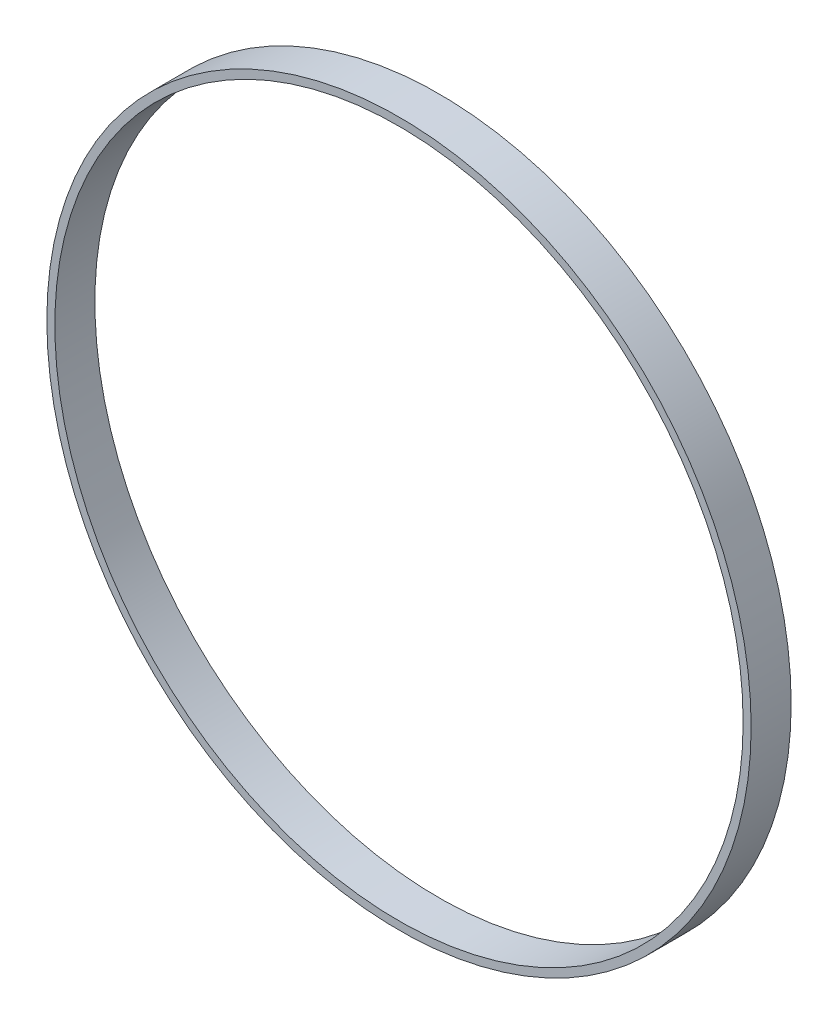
ISO-10303-21;
HEADER;
FILE_DESCRIPTION(('STEP AP214'),'2;1');
FILE_NAME('part.step','',(''),(''),'','','');
FILE_SCHEMA(('AUTOMOTIVE_DESIGN { 1 0 10303 214 1 1 1 1 }'));
ENDSEC;
DATA;
#1=APPLICATION_CONTEXT('core data for automotive mechanical design processes');
#2=APPLICATION_PROTOCOL_DEFINITION('international standard','automotive_design',2000,#1);
#3=PRODUCT_CONTEXT('',#1,'mechanical');
#4=PRODUCT('Part','Part','',(#3));
#5=PRODUCT_RELATED_PRODUCT_CATEGORY('part','',(#4));
#6=PRODUCT_DEFINITION_FORMATION('','',#4);
#7=PRODUCT_DEFINITION_CONTEXT('part definition',#1,'design');
#8=PRODUCT_DEFINITION('design','',#6,#7);
#9=PRODUCT_DEFINITION_SHAPE('','',#8);
#10=(LENGTH_UNIT() NAMED_UNIT(*) SI_UNIT(.MILLI.,.METRE.));
#11=(NAMED_UNIT(*) PLANE_ANGLE_UNIT() SI_UNIT($,.RADIAN.));
#12=(NAMED_UNIT(*) SI_UNIT($,.STERADIAN.) SOLID_ANGLE_UNIT());
#13=UNCERTAINTY_MEASURE_WITH_UNIT(LENGTH_MEASURE(1.E-05),#10,'distance_accuracy_value','');
#14=(GEOMETRIC_REPRESENTATION_CONTEXT(3) GLOBAL_UNCERTAINTY_ASSIGNED_CONTEXT((#13)) GLOBAL_UNIT_ASSIGNED_CONTEXT((#10,
#11,#12)) REPRESENTATION_CONTEXT('',''));
#15=CARTESIAN_POINT('',(0.,0.,0.));
#16=DIRECTION('',(0.,0.,1.));
#17=DIRECTION('',(1.,0.,0.));
#18=AXIS2_PLACEMENT_3D('',#15,#16,#17);
#19=CARTESIAN_POINT('',(0.,0.,5.));
#20=DIRECTION('',(0.,0.,1.));
#21=DIRECTION('',(1.,0.,0.));
#22=AXIS2_PLACEMENT_3D('',#19,#20,#21);
#23=PLANE('',#22);
#24=CARTESIAN_POINT('',(0.,0.,5.));
#25=DIRECTION('',(0.,0.,1.));
#26=DIRECTION('',(1.,0.,0.));
#27=AXIS2_PLACEMENT_3D('',#24,#25,#26);
#28=CIRCLE('',#27,44.);
#29=CARTESIAN_POINT('',(44.,0.,5.));
#30=VERTEX_POINT('',#29);
#31=EDGE_CURVE('E10',#30,#30,#28,.T.);
#32=ORIENTED_EDGE('',*,*,#31,.T.);
#33=EDGE_LOOP('',(#32));
#34=FACE_BOUND('',#33,.T.);
#35=CARTESIAN_POINT('',(0.,0.,5.));
#36=DIRECTION('',(0.,0.,1.));
#37=DIRECTION('',(1.,0.,0.));
#38=AXIS2_PLACEMENT_3D('',#35,#36,#37);
#39=CIRCLE('',#38,43.);
#40=CARTESIAN_POINT('',(43.,0.,5.));
#41=VERTEX_POINT('',#40);
#42=EDGE_CURVE('E42',#41,#41,#39,.T.);
#43=ORIENTED_EDGE('',*,*,#42,.F.);
#44=EDGE_LOOP('',(#43));
#45=FACE_BOUND('',#44,.T.);
#46=ADVANCED_FACE('F31',(#34,#45),#23,.T.);
#47=CARTESIAN_POINT('',(0.,0.,0.));
#48=DIRECTION('',(0.,0.,1.));
#49=DIRECTION('',(1.,0.,0.));
#50=AXIS2_PLACEMENT_3D('',#47,#48,#49);
#51=PLANE('',#50);
#52=CARTESIAN_POINT('',(0.,0.,0.));
#53=DIRECTION('',(0.,0.,1.));
#54=DIRECTION('',(1.,0.,0.));
#55=AXIS2_PLACEMENT_3D('',#52,#53,#54);
#56=CIRCLE('',#55,44.);
#57=CARTESIAN_POINT('',(44.,0.,0.));
#58=VERTEX_POINT('',#57);
#59=EDGE_CURVE('E35',#58,#58,#56,.T.);
#60=ORIENTED_EDGE('',*,*,#59,.F.);
#61=EDGE_LOOP('',(#60));
#62=FACE_BOUND('',#61,.T.);
#63=CARTESIAN_POINT('',(0.,0.,0.));
#64=DIRECTION('',(0.,0.,1.));
#65=DIRECTION('',(1.,0.,0.));
#66=AXIS2_PLACEMENT_3D('',#63,#64,#65);
#67=CIRCLE('',#66,43.);
#68=CARTESIAN_POINT('',(43.,0.,0.));
#69=VERTEX_POINT('',#68);
#70=EDGE_CURVE('E44',#69,#69,#67,.T.);
#71=ORIENTED_EDGE('',*,*,#70,.T.);
#72=EDGE_LOOP('',(#71));
#73=FACE_BOUND('',#72,.T.);
#74=ADVANCED_FACE('F54',(#62,#73),#51,.F.);
#75=CARTESIAN_POINT('',(0.,0.,5.));
#76=DIRECTION('',(0.,0.,-1.));
#77=DIRECTION('',(-1.,0.,0.));
#78=AXIS2_PLACEMENT_3D('',#75,#76,#77);
#79=CYLINDRICAL_SURFACE('',#78,44.);
#80=ORIENTED_EDGE('',*,*,#31,.F.);
#81=EDGE_LOOP('',(#80));
#82=FACE_BOUND('',#81,.T.);
#83=ORIENTED_EDGE('',*,*,#59,.T.);
#84=EDGE_LOOP('',(#83));
#85=FACE_BOUND('',#84,.T.);
#86=ADVANCED_FACE('F33',(#82,#85),#79,.T.);
#87=CARTESIAN_POINT('',(0.,0.,5.));
#88=DIRECTION('',(0.,0.,-1.));
#89=DIRECTION('',(-1.,0.,0.));
#90=AXIS2_PLACEMENT_3D('',#87,#88,#89);
#91=CYLINDRICAL_SURFACE('',#90,43.);
#92=ORIENTED_EDGE('',*,*,#42,.T.);
#93=EDGE_LOOP('',(#92));
#94=FACE_BOUND('',#93,.T.);
#95=ORIENTED_EDGE('',*,*,#70,.F.);
#96=EDGE_LOOP('',(#95));
#97=FACE_BOUND('',#96,.T.);
#98=ADVANCED_FACE('F50',(#94,#97),#91,.F.);
#99=CLOSED_SHELL('',(#46,#74,#86,#98));
#100=MANIFOLD_SOLID_BREP('B2',#99);
#101=ADVANCED_BREP_SHAPE_REPRESENTATION('',(#18,#100),#14);
#102=SHAPE_DEFINITION_REPRESENTATION(#9,#101);
ENDSEC;
END-ISO-10303-21;
